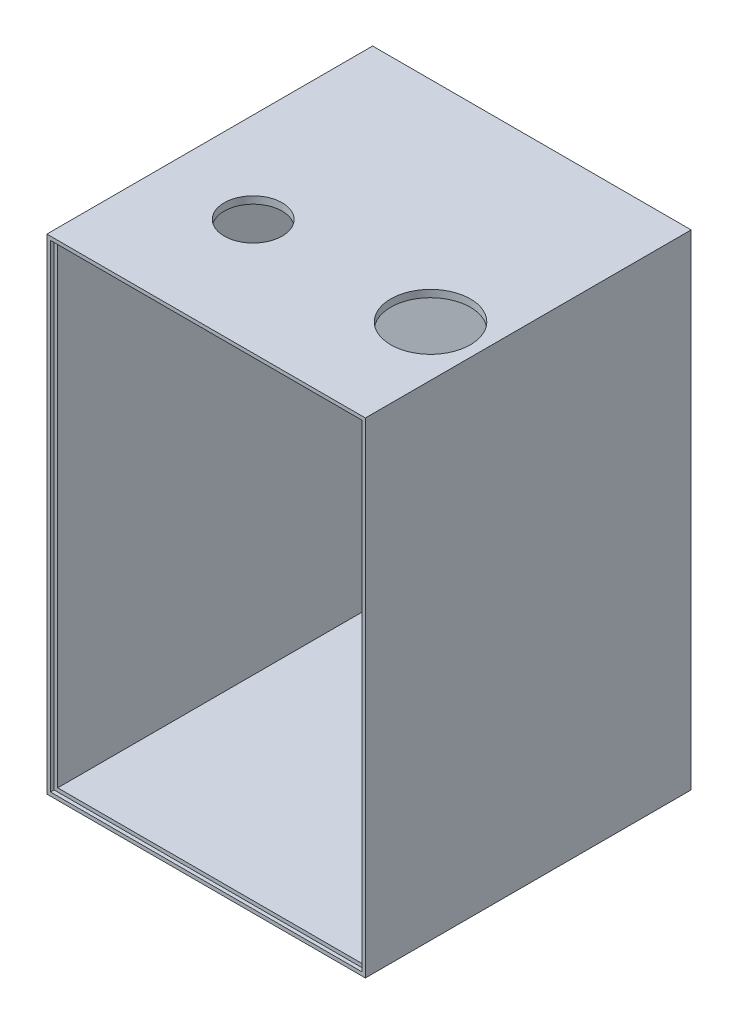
ISO-10303-21;
HEADER;
FILE_DESCRIPTION(('STEP AP214'),'2;1');
FILE_NAME('part.step','',(''),(''),'','','');
FILE_SCHEMA(('AUTOMOTIVE_DESIGN { 1 0 10303 214 1 1 1 1 }'));
ENDSEC;
DATA;
#1=APPLICATION_CONTEXT('core data for automotive mechanical design processes');
#2=APPLICATION_PROTOCOL_DEFINITION('international standard','automotive_design',2000,#1);
#3=PRODUCT_CONTEXT('',#1,'mechanical');
#4=PRODUCT('Part','Part','',(#3));
#5=PRODUCT_RELATED_PRODUCT_CATEGORY('part','',(#4));
#6=PRODUCT_DEFINITION_FORMATION('','',#4);
#7=PRODUCT_DEFINITION_CONTEXT('part definition',#1,'design');
#8=PRODUCT_DEFINITION('design','',#6,#7);
#9=PRODUCT_DEFINITION_SHAPE('','',#8);
#10=(LENGTH_UNIT() NAMED_UNIT(*) SI_UNIT(.MILLI.,.METRE.));
#11=(NAMED_UNIT(*) PLANE_ANGLE_UNIT() SI_UNIT($,.RADIAN.));
#12=(NAMED_UNIT(*) SI_UNIT($,.STERADIAN.) SOLID_ANGLE_UNIT());
#13=UNCERTAINTY_MEASURE_WITH_UNIT(LENGTH_MEASURE(1.E-05),#10,'distance_accuracy_value','');
#14=(GEOMETRIC_REPRESENTATION_CONTEXT(3) GLOBAL_UNCERTAINTY_ASSIGNED_CONTEXT((#13)) GLOBAL_UNIT_ASSIGNED_CONTEXT((#10,
#11,#12)) REPRESENTATION_CONTEXT('',''));
#15=CARTESIAN_POINT('',(0.,0.,0.));
#16=DIRECTION('',(0.,0.,1.));
#17=DIRECTION('',(1.,0.,0.));
#18=AXIS2_PLACEMENT_3D('',#15,#16,#17);
#19=CARTESIAN_POINT('',(44.,-67.,2.));
#20=DIRECTION('',(-1.,0.,0.));
#21=DIRECTION('',(0.,0.,1.));
#22=AXIS2_PLACEMENT_3D('',#19,#20,#21);
#23=PLANE('',#22);
#24=DIRECTION('',(0.,1.,0.));
#25=VECTOR('',#24,1.);
#26=CARTESIAN_POINT('',(44.,-67.,0.));
#27=LINE('',#26,#25);
#28=CARTESIAN_POINT('',(44.,-67.,0.));
#29=VERTEX_POINT('',#28);
#30=CARTESIAN_POINT('',(44.,67.,0.));
#31=VERTEX_POINT('',#30);
#32=EDGE_CURVE('E231',#29,#31,#27,.T.);
#33=ORIENTED_EDGE('',*,*,#32,.T.);
#34=DIRECTION('',(0.,0.,-1.));
#35=VECTOR('',#34,1.);
#36=CARTESIAN_POINT('',(44.,67.,2.));
#37=LINE('',#36,#35);
#38=CARTESIAN_POINT('',(44.,67.,90.));
#39=VERTEX_POINT('',#38);
#40=EDGE_CURVE('E71',#39,#31,#37,.T.);
#41=ORIENTED_EDGE('',*,*,#40,.F.);
#42=DIRECTION('',(0.,1.,0.));
#43=VECTOR('',#42,1.);
#44=CARTESIAN_POINT('',(44.,-67.,90.));
#45=LINE('',#44,#43);
#46=CARTESIAN_POINT('',(44.,-67.,90.));
#47=VERTEX_POINT('',#46);
#48=EDGE_CURVE('E222',#47,#39,#45,.T.);
#49=ORIENTED_EDGE('',*,*,#48,.F.);
#50=DIRECTION('',(0.,0.,-1.));
#51=VECTOR('',#50,1.);
#52=CARTESIAN_POINT('',(44.,-67.,2.));
#53=LINE('',#52,#51);
#54=EDGE_CURVE('E240',#47,#29,#53,.T.);
#55=ORIENTED_EDGE('',*,*,#54,.T.);
#56=EDGE_LOOP('',(#33,#41,#49,#55));
#57=FACE_BOUND('',#56,.T.);
#58=ADVANCED_FACE('F63',(#57),#23,.F.);
#59=CARTESIAN_POINT('',(-44.,67.,2.));
#60=DIRECTION('',(0.,-1.,0.));
#61=DIRECTION('',(0.,0.,-1.));
#62=AXIS2_PLACEMENT_3D('',#59,#60,#61);
#63=PLANE('',#62);
#64=CARTESIAN_POINT('',(30.,67.,58.));
#65=DIRECTION('',(0.,1.,0.));
#66=DIRECTION('',(0.,0.,1.));
#67=AXIS2_PLACEMENT_3D('',#64,#65,#66);
#68=CIRCLE('',#67,11.);
#69=CARTESIAN_POINT('',(30.,67.,69.));
#70=VERTEX_POINT('',#69);
#71=EDGE_CURVE('E252',#70,#70,#68,.T.);
#72=ORIENTED_EDGE('',*,*,#71,.F.);
#73=EDGE_LOOP('',(#72));
#74=FACE_BOUND('',#73,.T.);
#75=CARTESIAN_POINT('',(-19.,67.,58.));
#76=DIRECTION('',(0.,1.,0.));
#77=DIRECTION('',(0.,0.,1.));
#78=AXIS2_PLACEMENT_3D('',#75,#76,#77);
#79=CIRCLE('',#78,8.);
#80=CARTESIAN_POINT('',(-19.,67.,66.));
#81=VERTEX_POINT('',#80);
#82=EDGE_CURVE('E178',#81,#81,#79,.T.);
#83=ORIENTED_EDGE('',*,*,#82,.F.);
#84=EDGE_LOOP('',(#83));
#85=FACE_BOUND('',#84,.T.);
#86=DIRECTION('',(-1.,0.,0.));
#87=VECTOR('',#86,1.);
#88=CARTESIAN_POINT('',(-44.,67.,0.));
#89=LINE('',#88,#87);
#90=CARTESIAN_POINT('',(-44.,67.,0.));
#91=VERTEX_POINT('',#90);
#92=EDGE_CURVE('E234',#31,#91,#89,.T.);
#93=ORIENTED_EDGE('',*,*,#92,.T.);
#94=DIRECTION('',(0.,0.,-1.));
#95=VECTOR('',#94,1.);
#96=CARTESIAN_POINT('',(-44.,67.,2.));
#97=LINE('',#96,#95);
#98=CARTESIAN_POINT('',(-44.,67.,90.));
#99=VERTEX_POINT('',#98);
#100=EDGE_CURVE('E246',#99,#91,#97,.T.);
#101=ORIENTED_EDGE('',*,*,#100,.F.);
#102=DIRECTION('',(1.,0.,0.));
#103=VECTOR('',#102,1.);
#104=CARTESIAN_POINT('',(-44.,67.,90.));
#105=LINE('',#104,#103);
#106=EDGE_CURVE('E214',#99,#39,#105,.T.);
#107=ORIENTED_EDGE('',*,*,#106,.T.);
#108=ORIENTED_EDGE('',*,*,#40,.T.);
#109=EDGE_LOOP('',(#93,#101,#107,#108));
#110=FACE_BOUND('',#109,.T.);
#111=ADVANCED_FACE('F265',(#74,#85,#110),#63,.F.);
#112=CARTESIAN_POINT('',(-44.,-67.,2.));
#113=DIRECTION('',(1.,0.,0.));
#114=DIRECTION('',(0.,0.,-1.));
#115=AXIS2_PLACEMENT_3D('',#112,#113,#114);
#116=PLANE('',#115);
#117=DIRECTION('',(0.,-1.,0.));
#118=VECTOR('',#117,1.);
#119=CARTESIAN_POINT('',(-44.,-67.,0.));
#120=LINE('',#119,#118);
#121=CARTESIAN_POINT('',(-44.,-67.,0.));
#122=VERTEX_POINT('',#121);
#123=EDGE_CURVE('E236',#91,#122,#120,.T.);
#124=ORIENTED_EDGE('',*,*,#123,.T.);
#125=DIRECTION('',(0.,0.,-1.));
#126=VECTOR('',#125,1.);
#127=CARTESIAN_POINT('',(-44.,-67.,2.));
#128=LINE('',#127,#126);
#129=CARTESIAN_POINT('',(-44.,-67.,90.));
#130=VERTEX_POINT('',#129);
#131=EDGE_CURVE('E243',#130,#122,#128,.T.);
#132=ORIENTED_EDGE('',*,*,#131,.F.);
#133=DIRECTION('',(0.,1.,0.));
#134=VECTOR('',#133,1.);
#135=CARTESIAN_POINT('',(-44.,-67.,90.));
#136=LINE('',#135,#134);
#137=EDGE_CURVE('E228',#130,#99,#136,.T.);
#138=ORIENTED_EDGE('',*,*,#137,.T.);
#139=ORIENTED_EDGE('',*,*,#100,.T.);
#140=EDGE_LOOP('',(#124,#132,#138,#139));
#141=FACE_BOUND('',#140,.T.);
#142=ADVANCED_FACE('F268',(#141),#116,.F.);
#143=CARTESIAN_POINT('',(-44.,-67.,2.));
#144=DIRECTION('',(0.,1.,0.));
#145=DIRECTION('',(0.,0.,1.));
#146=AXIS2_PLACEMENT_3D('',#143,#144,#145);
#147=PLANE('',#146);
#148=DIRECTION('',(1.,0.,0.));
#149=VECTOR('',#148,1.);
#150=CARTESIAN_POINT('',(-44.,-67.,0.));
#151=LINE('',#150,#149);
#152=EDGE_CURVE('E238',#122,#29,#151,.T.);
#153=ORIENTED_EDGE('',*,*,#152,.T.);
#154=ORIENTED_EDGE('',*,*,#54,.F.);
#155=DIRECTION('',(1.,0.,0.));
#156=VECTOR('',#155,1.);
#157=CARTESIAN_POINT('',(-44.,-67.,90.));
#158=LINE('',#157,#156);
#159=EDGE_CURVE('E225',#130,#47,#158,.T.);
#160=ORIENTED_EDGE('',*,*,#159,.F.);
#161=ORIENTED_EDGE('',*,*,#131,.T.);
#162=EDGE_LOOP('',(#153,#154,#160,#161));
#163=FACE_BOUND('',#162,.T.);
#164=ADVANCED_FACE('F279',(#163),#147,.F.);
#165=CARTESIAN_POINT('',(0.,0.,0.));
#166=DIRECTION('',(0.,0.,-1.));
#167=DIRECTION('',(-1.,0.,0.));
#168=AXIS2_PLACEMENT_3D('',#165,#166,#167);
#169=PLANE('',#168);
#170=ORIENTED_EDGE('',*,*,#32,.F.);
#171=ORIENTED_EDGE('',*,*,#152,.F.);
#172=ORIENTED_EDGE('',*,*,#123,.F.);
#173=ORIENTED_EDGE('',*,*,#92,.F.);
#174=EDGE_LOOP('',(#170,#171,#172,#173));
#175=FACE_BOUND('',#174,.T.);
#176=ADVANCED_FACE('F277',(#175),#169,.T.);
#177=CARTESIAN_POINT('',(0.,0.,90.));
#178=DIRECTION('',(0.,0.,1.));
#179=DIRECTION('',(1.,0.,0.));
#180=AXIS2_PLACEMENT_3D('',#177,#178,#179);
#181=PLANE('',#180);
#182=DIRECTION('',(0.,1.,0.));
#183=VECTOR('',#182,1.);
#184=CARTESIAN_POINT('',(43.,-66.,90.));
#185=LINE('',#184,#183);
#186=CARTESIAN_POINT('',(43.,-66.,90.));
#187=VERTEX_POINT('',#186);
#188=CARTESIAN_POINT('',(43.,66.,90.));
#189=VERTEX_POINT('',#188);
#190=EDGE_CURVE('E79',#187,#189,#185,.T.);
#191=ORIENTED_EDGE('',*,*,#190,.F.);
#192=DIRECTION('',(1.,0.,0.));
#193=VECTOR('',#192,1.);
#194=CARTESIAN_POINT('',(-43.,-66.,90.));
#195=LINE('',#194,#193);
#196=CARTESIAN_POINT('',(-43.,-66.,90.));
#197=VERTEX_POINT('',#196);
#198=EDGE_CURVE('E172',#197,#187,#195,.T.);
#199=ORIENTED_EDGE('',*,*,#198,.F.);
#200=DIRECTION('',(0.,-1.,0.));
#201=VECTOR('',#200,1.);
#202=CARTESIAN_POINT('',(-43.,-66.,90.));
#203=LINE('',#202,#201);
#204=CARTESIAN_POINT('',(-43.,66.,90.));
#205=VERTEX_POINT('',#204);
#206=EDGE_CURVE('E175',#205,#197,#203,.T.);
#207=ORIENTED_EDGE('',*,*,#206,.F.);
#208=DIRECTION('',(-1.,0.,0.));
#209=VECTOR('',#208,1.);
#210=CARTESIAN_POINT('',(-43.,66.,90.));
#211=LINE('',#210,#209);
#212=EDGE_CURVE('E184',#189,#205,#211,.T.);
#213=ORIENTED_EDGE('',*,*,#212,.F.);
#214=EDGE_LOOP('',(#191,#199,#207,#213));
#215=FACE_BOUND('',#214,.T.);
#216=ORIENTED_EDGE('',*,*,#106,.F.);
#217=ORIENTED_EDGE('',*,*,#137,.F.);
#218=ORIENTED_EDGE('',*,*,#159,.T.);
#219=ORIENTED_EDGE('',*,*,#48,.T.);
#220=EDGE_LOOP('',(#216,#217,#218,#219));
#221=FACE_BOUND('',#220,.T.);
#222=ADVANCED_FACE('F284',(#215,#221),#181,.T.);
#223=CARTESIAN_POINT('',(0.,0.,89.));
#224=DIRECTION('',(0.,0.,-1.));
#225=DIRECTION('',(-1.,0.,0.));
#226=AXIS2_PLACEMENT_3D('',#223,#224,#225);
#227=PLANE('',#226);
#228=DIRECTION('',(0.,1.,0.));
#229=VECTOR('',#228,1.);
#230=CARTESIAN_POINT('',(43.,-66.,89.));
#231=LINE('',#230,#229);
#232=CARTESIAN_POINT('',(43.,-66.,89.));
#233=VERTEX_POINT('',#232);
#234=CARTESIAN_POINT('',(43.,66.,89.));
#235=VERTEX_POINT('',#234);
#236=EDGE_CURVE('E154',#233,#235,#231,.T.);
#237=ORIENTED_EDGE('',*,*,#236,.T.);
#238=DIRECTION('',(-1.,0.,0.));
#239=VECTOR('',#238,1.);
#240=CARTESIAN_POINT('',(-43.,66.,89.));
#241=LINE('',#240,#239);
#242=CARTESIAN_POINT('',(-43.,66.,89.));
#243=VERTEX_POINT('',#242);
#244=EDGE_CURVE('E163',#235,#243,#241,.T.);
#245=ORIENTED_EDGE('',*,*,#244,.T.);
#246=DIRECTION('',(0.,-1.,0.));
#247=VECTOR('',#246,1.);
#248=CARTESIAN_POINT('',(-43.,-66.,89.));
#249=LINE('',#248,#247);
#250=CARTESIAN_POINT('',(-43.,-66.,89.));
#251=VERTEX_POINT('',#250);
#252=EDGE_CURVE('E168',#243,#251,#249,.T.);
#253=ORIENTED_EDGE('',*,*,#252,.T.);
#254=DIRECTION('',(1.,0.,0.));
#255=VECTOR('',#254,1.);
#256=CARTESIAN_POINT('',(-43.,-66.,89.));
#257=LINE('',#256,#255);
#258=EDGE_CURVE('E160',#251,#233,#257,.T.);
#259=ORIENTED_EDGE('',*,*,#258,.T.);
#260=EDGE_LOOP('',(#237,#245,#253,#259));
#261=FACE_BOUND('',#260,.T.);
#262=DIRECTION('',(0.,-1.,0.));
#263=VECTOR('',#262,1.);
#264=CARTESIAN_POINT('',(42.,-65.,89.));
#265=LINE('',#264,#263);
#266=CARTESIAN_POINT('',(42.,65.,89.));
#267=VERTEX_POINT('',#266);
#268=CARTESIAN_POINT('',(42.,-65.,89.));
#269=VERTEX_POINT('',#268);
#270=EDGE_CURVE('E12',#267,#269,#265,.T.);
#271=ORIENTED_EDGE('',*,*,#270,.T.);
#272=DIRECTION('',(-1.,0.,0.));
#273=VECTOR('',#272,1.);
#274=CARTESIAN_POINT('',(-42.,-65.,89.));
#275=LINE('',#274,#273);
#276=CARTESIAN_POINT('',(-42.,-65.,89.));
#277=VERTEX_POINT('',#276);
#278=EDGE_CURVE('E190',#269,#277,#275,.T.);
#279=ORIENTED_EDGE('',*,*,#278,.T.);
#280=DIRECTION('',(0.,-1.,0.));
#281=VECTOR('',#280,1.);
#282=CARTESIAN_POINT('',(-42.,-65.,89.));
#283=LINE('',#282,#281);
#284=CARTESIAN_POINT('',(-42.,65.,89.));
#285=VERTEX_POINT('',#284);
#286=EDGE_CURVE('E195',#285,#277,#283,.T.);
#287=ORIENTED_EDGE('',*,*,#286,.F.);
#288=DIRECTION('',(-1.,0.,0.));
#289=VECTOR('',#288,1.);
#290=CARTESIAN_POINT('',(-42.,65.,89.));
#291=LINE('',#290,#289);
#292=EDGE_CURVE('E86',#267,#285,#291,.T.);
#293=ORIENTED_EDGE('',*,*,#292,.F.);
#294=EDGE_LOOP('',(#271,#279,#287,#293));
#295=FACE_BOUND('',#294,.T.);
#296=ADVANCED_FACE('F170',(#261,#295),#227,.F.);
#297=CARTESIAN_POINT('',(43.,-66.,89.));
#298=DIRECTION('',(1.,0.,0.));
#299=DIRECTION('',(0.,0.,-1.));
#300=AXIS2_PLACEMENT_3D('',#297,#298,#299);
#301=PLANE('',#300);
#302=ORIENTED_EDGE('',*,*,#190,.T.);
#303=DIRECTION('',(0.,0.,1.));
#304=VECTOR('',#303,1.);
#305=CARTESIAN_POINT('',(43.,66.,89.));
#306=LINE('',#305,#304);
#307=EDGE_CURVE('E150',#235,#189,#306,.T.);
#308=ORIENTED_EDGE('',*,*,#307,.F.);
#309=ORIENTED_EDGE('',*,*,#236,.F.);
#310=DIRECTION('',(0.,0.,1.));
#311=VECTOR('',#310,1.);
#312=CARTESIAN_POINT('',(43.,-66.,89.));
#313=LINE('',#312,#311);
#314=EDGE_CURVE('E188',#233,#187,#313,.T.);
#315=ORIENTED_EDGE('',*,*,#314,.T.);
#316=EDGE_LOOP('',(#302,#308,#309,#315));
#317=FACE_BOUND('',#316,.T.);
#318=ADVANCED_FACE('F152',(#317),#301,.F.);
#319=CARTESIAN_POINT('',(-43.,-66.,89.));
#320=DIRECTION('',(0.,-1.,0.));
#321=DIRECTION('',(0.,0.,-1.));
#322=AXIS2_PLACEMENT_3D('',#319,#320,#321);
#323=PLANE('',#322);
#324=ORIENTED_EDGE('',*,*,#198,.T.);
#325=ORIENTED_EDGE('',*,*,#314,.F.);
#326=ORIENTED_EDGE('',*,*,#258,.F.);
#327=DIRECTION('',(0.,0.,1.));
#328=VECTOR('',#327,1.);
#329=CARTESIAN_POINT('',(-43.,-66.,89.));
#330=LINE('',#329,#328);
#331=EDGE_CURVE('E191',#251,#197,#330,.T.);
#332=ORIENTED_EDGE('',*,*,#331,.T.);
#333=EDGE_LOOP('',(#324,#325,#326,#332));
#334=FACE_BOUND('',#333,.T.);
#335=ADVANCED_FACE('F423',(#334),#323,.F.);
#336=CARTESIAN_POINT('',(-43.,-66.,89.));
#337=DIRECTION('',(-1.,0.,0.));
#338=DIRECTION('',(0.,0.,1.));
#339=AXIS2_PLACEMENT_3D('',#336,#337,#338);
#340=PLANE('',#339);
#341=ORIENTED_EDGE('',*,*,#206,.T.);
#342=ORIENTED_EDGE('',*,*,#331,.F.);
#343=ORIENTED_EDGE('',*,*,#252,.F.);
#344=DIRECTION('',(0.,0.,1.));
#345=VECTOR('',#344,1.);
#346=CARTESIAN_POINT('',(-43.,66.,89.));
#347=LINE('',#346,#345);
#348=EDGE_CURVE('E159',#243,#205,#347,.T.);
#349=ORIENTED_EDGE('',*,*,#348,.T.);
#350=EDGE_LOOP('',(#341,#342,#343,#349));
#351=FACE_BOUND('',#350,.T.);
#352=ADVANCED_FACE('F433',(#351),#340,.F.);
#353=CARTESIAN_POINT('',(-43.,66.,89.));
#354=DIRECTION('',(0.,1.,0.));
#355=DIRECTION('',(0.,0.,1.));
#356=AXIS2_PLACEMENT_3D('',#353,#354,#355);
#357=PLANE('',#356);
#358=ORIENTED_EDGE('',*,*,#212,.T.);
#359=ORIENTED_EDGE('',*,*,#348,.F.);
#360=ORIENTED_EDGE('',*,*,#244,.F.);
#361=ORIENTED_EDGE('',*,*,#307,.T.);
#362=EDGE_LOOP('',(#358,#359,#360,#361));
#363=FACE_BOUND('',#362,.T.);
#364=ADVANCED_FACE('F164',(#363),#357,.F.);
#365=CARTESIAN_POINT('',(0.,0.,2.));
#366=DIRECTION('',(0.,0.,-1.));
#367=DIRECTION('',(-1.,0.,0.));
#368=AXIS2_PLACEMENT_3D('',#365,#366,#367);
#369=PLANE('',#368);
#370=DIRECTION('',(1.,0.,0.));
#371=VECTOR('',#370,1.);
#372=CARTESIAN_POINT('',(-42.,65.,2.));
#373=LINE('',#372,#371);
#374=CARTESIAN_POINT('',(-42.,65.,2.));
#375=VERTEX_POINT('',#374);
#376=CARTESIAN_POINT('',(42.,65.,2.));
#377=VERTEX_POINT('',#376);
#378=EDGE_CURVE('E199',#375,#377,#373,.T.);
#379=ORIENTED_EDGE('',*,*,#378,.F.);
#380=DIRECTION('',(0.,1.,0.));
#381=VECTOR('',#380,1.);
#382=CARTESIAN_POINT('',(-42.,-65.,2.));
#383=LINE('',#382,#381);
#384=CARTESIAN_POINT('',(-42.,-65.,2.));
#385=VERTEX_POINT('',#384);
#386=EDGE_CURVE('E208',#385,#375,#383,.T.);
#387=ORIENTED_EDGE('',*,*,#386,.F.);
#388=DIRECTION('',(1.,0.,0.));
#389=VECTOR('',#388,1.);
#390=CARTESIAN_POINT('',(-42.,-65.,2.));
#391=LINE('',#390,#389);
#392=CARTESIAN_POINT('',(42.,-65.,2.));
#393=VERTEX_POINT('',#392);
#394=EDGE_CURVE('E205',#385,#393,#391,.T.);
#395=ORIENTED_EDGE('',*,*,#394,.T.);
#396=DIRECTION('',(0.,1.,0.));
#397=VECTOR('',#396,1.);
#398=CARTESIAN_POINT('',(42.,-65.,2.));
#399=LINE('',#398,#397);
#400=EDGE_CURVE('E202',#393,#377,#399,.T.);
#401=ORIENTED_EDGE('',*,*,#400,.T.);
#402=EDGE_LOOP('',(#379,#387,#395,#401));
#403=FACE_BOUND('',#402,.T.);
#404=ADVANCED_FACE('F335',(#403),#369,.F.);
#405=CARTESIAN_POINT('',(42.,-65.,90.));
#406=DIRECTION('',(-1.,0.,0.));
#407=DIRECTION('',(0.,0.,1.));
#408=AXIS2_PLACEMENT_3D('',#405,#406,#407);
#409=PLANE('',#408);
#410=ORIENTED_EDGE('',*,*,#270,.F.);
#411=DIRECTION('',(0.,0.,-1.));
#412=VECTOR('',#411,1.);
#413=CARTESIAN_POINT('',(42.,65.,90.));
#414=LINE('',#413,#412);
#415=EDGE_CURVE('E211',#267,#377,#414,.T.);
#416=ORIENTED_EDGE('',*,*,#415,.T.);
#417=ORIENTED_EDGE('',*,*,#400,.F.);
#418=DIRECTION('',(0.,0.,-1.));
#419=VECTOR('',#418,1.);
#420=CARTESIAN_POINT('',(42.,-65.,90.));
#421=LINE('',#420,#419);
#422=EDGE_CURVE('E217',#269,#393,#421,.T.);
#423=ORIENTED_EDGE('',*,*,#422,.F.);
#424=EDGE_LOOP('',(#410,#416,#417,#423));
#425=FACE_BOUND('',#424,.T.);
#426=ADVANCED_FACE('F339',(#425),#409,.T.);
#427=CARTESIAN_POINT('',(-42.,-65.,90.));
#428=DIRECTION('',(0.,1.,0.));
#429=DIRECTION('',(0.,0.,1.));
#430=AXIS2_PLACEMENT_3D('',#427,#428,#429);
#431=PLANE('',#430);
#432=ORIENTED_EDGE('',*,*,#278,.F.);
#433=ORIENTED_EDGE('',*,*,#422,.T.);
#434=ORIENTED_EDGE('',*,*,#394,.F.);
#435=DIRECTION('',(0.,0.,-1.));
#436=VECTOR('',#435,1.);
#437=CARTESIAN_POINT('',(-42.,-65.,90.));
#438=LINE('',#437,#436);
#439=EDGE_CURVE('E215',#277,#385,#438,.T.);
#440=ORIENTED_EDGE('',*,*,#439,.F.);
#441=EDGE_LOOP('',(#432,#433,#434,#440));
#442=FACE_BOUND('',#441,.T.);
#443=ADVANCED_FACE('F385',(#442),#431,.T.);
#444=CARTESIAN_POINT('',(-42.,-65.,90.));
#445=DIRECTION('',(-1.,0.,0.));
#446=DIRECTION('',(0.,0.,1.));
#447=AXIS2_PLACEMENT_3D('',#444,#445,#446);
#448=PLANE('',#447);
#449=DIRECTION('',(0.,0.,-1.));
#450=VECTOR('',#449,1.);
#451=CARTESIAN_POINT('',(-42.,65.,90.));
#452=LINE('',#451,#450);
#453=EDGE_CURVE('E212',#285,#375,#452,.T.);
#454=ORIENTED_EDGE('',*,*,#453,.F.);
#455=ORIENTED_EDGE('',*,*,#286,.T.);
#456=ORIENTED_EDGE('',*,*,#439,.T.);
#457=ORIENTED_EDGE('',*,*,#386,.T.);
#458=EDGE_LOOP('',(#454,#455,#456,#457));
#459=FACE_BOUND('',#458,.T.);
#460=ADVANCED_FACE('F375',(#459),#448,.F.);
#461=CARTESIAN_POINT('',(-42.,65.,90.));
#462=DIRECTION('',(0.,1.,0.));
#463=DIRECTION('',(0.,0.,1.));
#464=AXIS2_PLACEMENT_3D('',#461,#462,#463);
#465=PLANE('',#464);
#466=CARTESIAN_POINT('',(30.,65.,58.));
#467=DIRECTION('',(0.,1.,0.));
#468=DIRECTION('',(0.,0.,1.));
#469=AXIS2_PLACEMENT_3D('',#466,#467,#468);
#470=CIRCLE('',#469,11.);
#471=CARTESIAN_POINT('',(30.,65.,69.));
#472=VERTEX_POINT('',#471);
#473=EDGE_CURVE('E66',#472,#472,#470,.T.);
#474=ORIENTED_EDGE('',*,*,#473,.T.);
#475=EDGE_LOOP('',(#474));
#476=FACE_BOUND('',#475,.T.);
#477=CARTESIAN_POINT('',(-19.,65.,58.));
#478=DIRECTION('',(0.,1.,0.));
#479=DIRECTION('',(0.,0.,1.));
#480=AXIS2_PLACEMENT_3D('',#477,#478,#479);
#481=CIRCLE('',#480,8.);
#482=CARTESIAN_POINT('',(-19.,65.,66.));
#483=VERTEX_POINT('',#482);
#484=EDGE_CURVE('E250',#483,#483,#481,.T.);
#485=ORIENTED_EDGE('',*,*,#484,.T.);
#486=EDGE_LOOP('',(#485));
#487=FACE_BOUND('',#486,.T.);
#488=ORIENTED_EDGE('',*,*,#415,.F.);
#489=ORIENTED_EDGE('',*,*,#292,.T.);
#490=ORIENTED_EDGE('',*,*,#453,.T.);
#491=ORIENTED_EDGE('',*,*,#378,.T.);
#492=EDGE_LOOP('',(#488,#489,#490,#491));
#493=FACE_BOUND('',#492,.T.);
#494=ADVANCED_FACE('F370',(#476,#487,#493),#465,.F.);
#495=CARTESIAN_POINT('',(-19.,56.,58.));
#496=DIRECTION('',(0.,1.,0.));
#497=DIRECTION('',(0.,0.,1.));
#498=AXIS2_PLACEMENT_3D('',#495,#496,#497);
#499=CYLINDRICAL_SURFACE('',#498,8.);
#500=ORIENTED_EDGE('',*,*,#82,.T.);
#501=EDGE_LOOP('',(#500));
#502=FACE_BOUND('',#501,.T.);
#503=ORIENTED_EDGE('',*,*,#484,.F.);
#504=EDGE_LOOP('',(#503));
#505=FACE_BOUND('',#504,.T.);
#506=ADVANCED_FACE('F262',(#502,#505),#499,.F.);
#507=CARTESIAN_POINT('',(30.,56.,58.));
#508=DIRECTION('',(0.,1.,0.));
#509=DIRECTION('',(0.,0.,1.));
#510=AXIS2_PLACEMENT_3D('',#507,#508,#509);
#511=CYLINDRICAL_SURFACE('',#510,11.);
#512=ORIENTED_EDGE('',*,*,#71,.T.);
#513=EDGE_LOOP('',(#512));
#514=FACE_BOUND('',#513,.T.);
#515=ORIENTED_EDGE('',*,*,#473,.F.);
#516=EDGE_LOOP('',(#515));
#517=FACE_BOUND('',#516,.T.);
#518=ADVANCED_FACE('F461',(#514,#517),#511,.F.);
#519=CLOSED_SHELL('',(#58,#111,#142,#164,#176,#222,#296,#318,#335,#352,#364,#404,#426,#443,#460,
#494,#506,#518));
#520=MANIFOLD_SOLID_BREP('B2',#519);
#521=ADVANCED_BREP_SHAPE_REPRESENTATION('',(#18,#520),#14);
#522=SHAPE_DEFINITION_REPRESENTATION(#9,#521);
ENDSEC;
END-ISO-10303-21;
